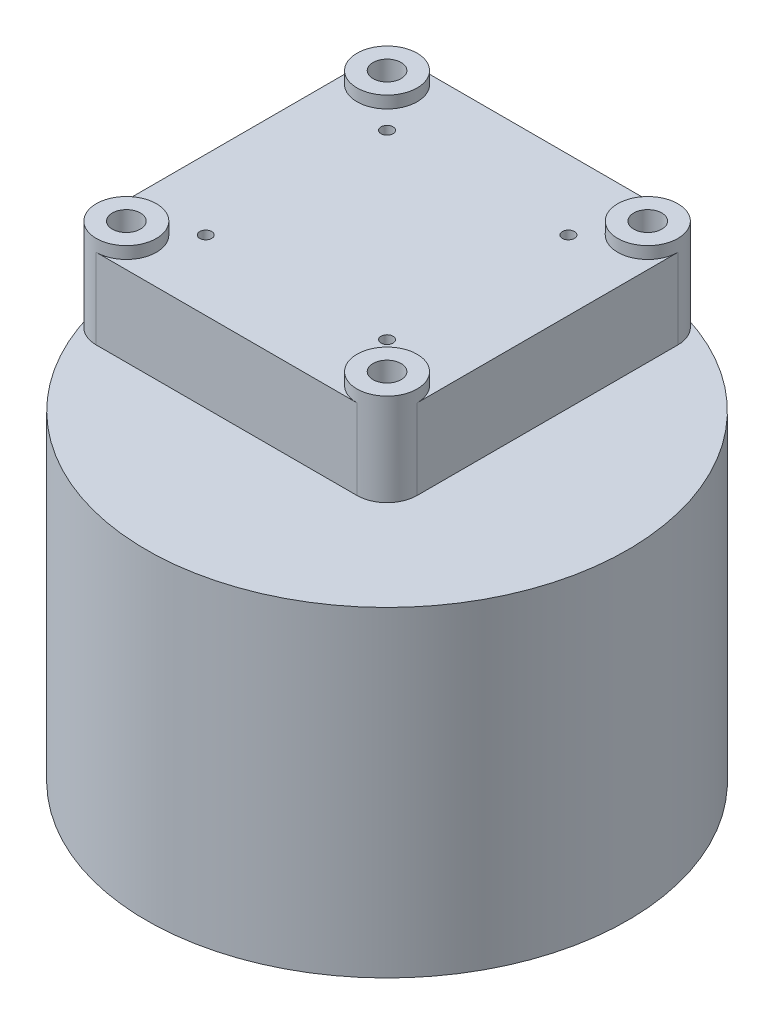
ISO-10303-21;
HEADER;
FILE_DESCRIPTION(('STEP AP214'),'2;1');
FILE_NAME('part.step','',(''),(''),'','','');
FILE_SCHEMA(('AUTOMOTIVE_DESIGN { 1 0 10303 214 1 1 1 1 }'));
ENDSEC;
DATA;
#1=APPLICATION_CONTEXT('core data for automotive mechanical design processes');
#2=APPLICATION_PROTOCOL_DEFINITION('international standard','automotive_design',2000,#1);
#3=PRODUCT_CONTEXT('',#1,'mechanical');
#4=PRODUCT('Part','Part','',(#3));
#5=PRODUCT_RELATED_PRODUCT_CATEGORY('part','',(#4));
#6=PRODUCT_DEFINITION_FORMATION('','',#4);
#7=PRODUCT_DEFINITION_CONTEXT('part definition',#1,'design');
#8=PRODUCT_DEFINITION('design','',#6,#7);
#9=PRODUCT_DEFINITION_SHAPE('','',#8);
#10=(LENGTH_UNIT() NAMED_UNIT(*) SI_UNIT(.MILLI.,.METRE.));
#11=(NAMED_UNIT(*) PLANE_ANGLE_UNIT() SI_UNIT($,.RADIAN.));
#12=(NAMED_UNIT(*) SI_UNIT($,.STERADIAN.) SOLID_ANGLE_UNIT());
#13=UNCERTAINTY_MEASURE_WITH_UNIT(LENGTH_MEASURE(1.E-05),#10,'distance_accuracy_value','');
#14=(GEOMETRIC_REPRESENTATION_CONTEXT(3) GLOBAL_UNCERTAINTY_ASSIGNED_CONTEXT((#13)) GLOBAL_UNIT_ASSIGNED_CONTEXT((#10,
#11,#12)) REPRESENTATION_CONTEXT('',''));
#15=CARTESIAN_POINT('',(0.,0.,0.));
#16=DIRECTION('',(0.,0.,1.));
#17=DIRECTION('',(1.,0.,0.));
#18=AXIS2_PLACEMENT_3D('',#15,#16,#17);
#19=CARTESIAN_POINT('',(-32.5,20.,32.5));
#20=DIRECTION('',(0.,-1.,0.));
#21=DIRECTION('',(0.,0.,-1.));
#22=AXIS2_PLACEMENT_3D('',#19,#20,#21);
#23=PLANE('',#22);
#24=CARTESIAN_POINT('',(22.6005050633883,20.,-22.6005050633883));
#25=DIRECTION('',(0.,1.,0.));
#26=DIRECTION('',(0.,0.,-1.));
#27=AXIS2_PLACEMENT_3D('',#24,#25,#26);
#28=CIRCLE('',#27,1.5);
#29=CARTESIAN_POINT('',(22.6005050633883,20.,-24.1005050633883));
#30=VERTEX_POINT('',#29);
#31=EDGE_CURVE('E169',#30,#30,#28,.T.);
#32=ORIENTED_EDGE('',*,*,#31,.F.);
#33=EDGE_LOOP('',(#32));
#34=FACE_BOUND('',#33,.T.);
#35=CARTESIAN_POINT('',(-22.6005050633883,20.,-22.6005050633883));
#36=DIRECTION('',(0.,1.,0.));
#37=DIRECTION('',(0.,0.,1.));
#38=AXIS2_PLACEMENT_3D('',#35,#36,#37);
#39=CIRCLE('',#38,1.5);
#40=CARTESIAN_POINT('',(-22.6005050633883,20.,-21.1005050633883));
#41=VERTEX_POINT('',#40);
#42=EDGE_CURVE('E175',#41,#41,#39,.T.);
#43=ORIENTED_EDGE('',*,*,#42,.F.);
#44=EDGE_LOOP('',(#43));
#45=FACE_BOUND('',#44,.T.);
#46=CARTESIAN_POINT('',(-22.6005050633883,20.,22.6005050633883));
#47=DIRECTION('',(0.,1.,0.));
#48=DIRECTION('',(0.,0.,-1.));
#49=AXIS2_PLACEMENT_3D('',#46,#47,#48);
#50=CIRCLE('',#49,1.5);
#51=CARTESIAN_POINT('',(-22.6005050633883,20.,21.1005050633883));
#52=VERTEX_POINT('',#51);
#53=EDGE_CURVE('E181',#52,#52,#50,.T.);
#54=ORIENTED_EDGE('',*,*,#53,.F.);
#55=EDGE_LOOP('',(#54));
#56=FACE_BOUND('',#55,.T.);
#57=CARTESIAN_POINT('',(22.6005050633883,20.,22.6005050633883));
#58=DIRECTION('',(0.,1.,0.));
#59=DIRECTION('',(0.,0.,1.));
#60=AXIS2_PLACEMENT_3D('',#57,#58,#59);
#61=CIRCLE('',#60,1.5);
#62=CARTESIAN_POINT('',(22.6005050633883,20.,24.1005050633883));
#63=VERTEX_POINT('',#62);
#64=EDGE_CURVE('E187',#63,#63,#61,.T.);
#65=ORIENTED_EDGE('',*,*,#64,.F.);
#66=EDGE_LOOP('',(#65));
#67=FACE_BOUND('',#66,.T.);
#68=CARTESIAN_POINT('',(-32.5,20.,-32.5));
#69=DIRECTION('',(0.,1.,0.));
#70=DIRECTION('',(0.,0.,-1.));
#71=AXIS2_PLACEMENT_3D('',#68,#69,#70);
#72=CIRCLE('',#71,7.5);
#73=CARTESIAN_POINT('',(-40.,20.,-32.5));
#74=VERTEX_POINT('',#73);
#75=CARTESIAN_POINT('',(-32.5,20.,-40.));
#76=VERTEX_POINT('',#75);
#77=EDGE_CURVE('E120',#74,#76,#72,.T.);
#78=ORIENTED_EDGE('',*,*,#77,.F.);
#79=DIRECTION('',(0.,0.,1.));
#80=VECTOR('',#79,1.);
#81=CARTESIAN_POINT('',(-40.,20.,32.5));
#82=LINE('',#81,#80);
#83=CARTESIAN_POINT('',(-40.,20.,32.5));
#84=VERTEX_POINT('',#83);
#85=EDGE_CURVE('E55',#74,#84,#82,.T.);
#86=ORIENTED_EDGE('',*,*,#85,.T.);
#87=CARTESIAN_POINT('',(-32.5,20.,32.5));
#88=DIRECTION('',(0.,1.,0.));
#89=DIRECTION('',(0.,0.,1.));
#90=AXIS2_PLACEMENT_3D('',#87,#88,#89);
#91=CIRCLE('',#90,7.5);
#92=CARTESIAN_POINT('',(-32.5,20.,40.));
#93=VERTEX_POINT('',#92);
#94=EDGE_CURVE('E136',#93,#84,#91,.T.);
#95=ORIENTED_EDGE('',*,*,#94,.F.);
#96=DIRECTION('',(1.,0.,0.));
#97=VECTOR('',#96,1.);
#98=CARTESIAN_POINT('',(-32.5,20.,40.));
#99=LINE('',#98,#97);
#100=CARTESIAN_POINT('',(32.4999999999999,20.,40.));
#101=VERTEX_POINT('',#100);
#102=EDGE_CURVE('E98',#93,#101,#99,.T.);
#103=ORIENTED_EDGE('',*,*,#102,.T.);
#104=CARTESIAN_POINT('',(32.5,20.,32.5));
#105=DIRECTION('',(0.,1.,0.));
#106=DIRECTION('',(0.,0.,-1.));
#107=AXIS2_PLACEMENT_3D('',#104,#105,#106);
#108=CIRCLE('',#107,7.5);
#109=CARTESIAN_POINT('',(40.,20.,32.5));
#110=VERTEX_POINT('',#109);
#111=EDGE_CURVE('E144',#110,#101,#108,.T.);
#112=ORIENTED_EDGE('',*,*,#111,.F.);
#113=DIRECTION('',(0.,0.,-1.));
#114=VECTOR('',#113,1.);
#115=CARTESIAN_POINT('',(40.,20.,32.5));
#116=LINE('',#115,#114);
#117=CARTESIAN_POINT('',(40.,20.,-32.5));
#118=VERTEX_POINT('',#117);
#119=EDGE_CURVE('E206',#110,#118,#116,.T.);
#120=ORIENTED_EDGE('',*,*,#119,.T.);
#121=CARTESIAN_POINT('',(32.5,20.,-32.5));
#122=DIRECTION('',(0.,1.,0.));
#123=DIRECTION('',(0.,0.,1.));
#124=AXIS2_PLACEMENT_3D('',#121,#122,#123);
#125=CIRCLE('',#124,7.5);
#126=CARTESIAN_POINT('',(32.4999999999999,20.,-40.));
#127=VERTEX_POINT('',#126);
#128=EDGE_CURVE('E11',#127,#118,#125,.T.);
#129=ORIENTED_EDGE('',*,*,#128,.F.);
#130=DIRECTION('',(-1.,0.,0.));
#131=VECTOR('',#130,1.);
#132=CARTESIAN_POINT('',(-32.5,20.,-40.));
#133=LINE('',#132,#131);
#134=EDGE_CURVE('E115',#127,#76,#133,.T.);
#135=ORIENTED_EDGE('',*,*,#134,.T.);
#136=EDGE_LOOP('',(#78,#86,#95,#103,#112,#120,#129,#135));
#137=FACE_BOUND('',#136,.T.);
#138=ADVANCED_FACE('F37',(#34,#45,#56,#67,#137),#23,.F.);
#139=CARTESIAN_POINT('',(-32.5,0.,32.5));
#140=DIRECTION('',(0.,-1.,0.));
#141=DIRECTION('',(0.,0.,-1.));
#142=AXIS2_PLACEMENT_3D('',#139,#140,#141);
#143=PLANE('',#142);
#144=CARTESIAN_POINT('',(0.,0.,0.));
#145=DIRECTION('',(0.,-1.,0.));
#146=DIRECTION('',(0.,0.,-1.));
#147=AXIS2_PLACEMENT_3D('',#144,#145,#146);
#148=CIRCLE('',#147,17.5);
#149=CARTESIAN_POINT('',(0.,0.,-17.5));
#150=VERTEX_POINT('',#149);
#151=EDGE_CURVE('E160',#150,#150,#148,.T.);
#152=ORIENTED_EDGE('',*,*,#151,.F.);
#153=EDGE_LOOP('',(#152));
#154=FACE_BOUND('',#153,.T.);
#155=CARTESIAN_POINT('',(-22.6005050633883,0.,-22.6005050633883));
#156=DIRECTION('',(0.,1.,0.));
#157=DIRECTION('',(0.,0.,1.));
#158=AXIS2_PLACEMENT_3D('',#155,#156,#157);
#159=CIRCLE('',#158,1.5);
#160=CARTESIAN_POINT('',(-22.6005050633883,0.,-21.1005050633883));
#161=VERTEX_POINT('',#160);
#162=EDGE_CURVE('E172',#161,#161,#159,.T.);
#163=ORIENTED_EDGE('',*,*,#162,.T.);
#164=EDGE_LOOP('',(#163));
#165=FACE_BOUND('',#164,.T.);
#166=CARTESIAN_POINT('',(22.6005050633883,0.,22.6005050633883));
#167=DIRECTION('',(0.,1.,0.));
#168=DIRECTION('',(0.,0.,1.));
#169=AXIS2_PLACEMENT_3D('',#166,#167,#168);
#170=CIRCLE('',#169,1.5);
#171=CARTESIAN_POINT('',(22.6005050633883,0.,24.1005050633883));
#172=VERTEX_POINT('',#171);
#173=EDGE_CURVE('E184',#172,#172,#170,.T.);
#174=ORIENTED_EDGE('',*,*,#173,.T.);
#175=EDGE_LOOP('',(#174));
#176=FACE_BOUND('',#175,.T.);
#177=CARTESIAN_POINT('',(-32.5,0.,-32.5));
#178=DIRECTION('',(0.,1.,0.));
#179=DIRECTION('',(0.,0.,-1.));
#180=AXIS2_PLACEMENT_3D('',#177,#178,#179);
#181=CIRCLE('',#180,3.5);
#182=CARTESIAN_POINT('',(-32.5,0.,-36.));
#183=VERTEX_POINT('',#182);
#184=EDGE_CURVE('E195',#183,#183,#181,.T.);
#185=ORIENTED_EDGE('',*,*,#184,.T.);
#186=EDGE_LOOP('',(#185));
#187=FACE_BOUND('',#186,.T.);
#188=CARTESIAN_POINT('',(32.5,0.,-32.5));
#189=DIRECTION('',(0.,1.,0.));
#190=DIRECTION('',(0.,0.,1.));
#191=AXIS2_PLACEMENT_3D('',#188,#189,#190);
#192=CIRCLE('',#191,3.5);
#193=CARTESIAN_POINT('',(32.5,0.,-29.));
#194=VERTEX_POINT('',#193);
#195=EDGE_CURVE('E201',#194,#194,#192,.T.);
#196=ORIENTED_EDGE('',*,*,#195,.T.);
#197=EDGE_LOOP('',(#196));
#198=FACE_BOUND('',#197,.T.);
#199=CARTESIAN_POINT('',(-32.5,0.,32.5));
#200=DIRECTION('',(0.,1.,0.));
#201=DIRECTION('',(0.,0.,-1.));
#202=AXIS2_PLACEMENT_3D('',#199,#200,#201);
#203=CIRCLE('',#202,7.5);
#204=CARTESIAN_POINT('',(-40.,0.,32.5));
#205=VERTEX_POINT('',#204);
#206=CARTESIAN_POINT('',(-32.5,0.,40.));
#207=VERTEX_POINT('',#206);
#208=EDGE_CURVE('E204',#205,#207,#203,.T.);
#209=ORIENTED_EDGE('',*,*,#208,.F.);
#210=DIRECTION('',(0.,0.,1.));
#211=VECTOR('',#210,1.);
#212=CARTESIAN_POINT('',(-40.,0.,32.5));
#213=LINE('',#212,#211);
#214=CARTESIAN_POINT('',(-40.,0.,-32.4999999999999));
#215=VERTEX_POINT('',#214);
#216=EDGE_CURVE('E92',#215,#205,#213,.T.);
#217=ORIENTED_EDGE('',*,*,#216,.F.);
#218=CARTESIAN_POINT('',(-32.5,0.,-32.5));
#219=DIRECTION('',(0.,1.,0.));
#220=DIRECTION('',(0.,0.,-1.));
#221=AXIS2_PLACEMENT_3D('',#218,#219,#220);
#222=CIRCLE('',#221,7.5);
#223=CARTESIAN_POINT('',(-32.5,0.,-40.));
#224=VERTEX_POINT('',#223);
#225=EDGE_CURVE('E86',#224,#215,#222,.T.);
#226=ORIENTED_EDGE('',*,*,#225,.F.);
#227=DIRECTION('',(-1.,0.,0.));
#228=VECTOR('',#227,1.);
#229=CARTESIAN_POINT('',(-32.5,0.,-40.));
#230=LINE('',#229,#228);
#231=CARTESIAN_POINT('',(32.4999999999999,0.,-40.));
#232=VERTEX_POINT('',#231);
#233=EDGE_CURVE('E220',#232,#224,#230,.T.);
#234=ORIENTED_EDGE('',*,*,#233,.F.);
#235=CARTESIAN_POINT('',(32.5,0.,-32.5));
#236=DIRECTION('',(0.,1.,0.));
#237=DIRECTION('',(0.,0.,-1.));
#238=AXIS2_PLACEMENT_3D('',#235,#236,#237);
#239=CIRCLE('',#238,7.5);
#240=CARTESIAN_POINT('',(40.,0.,-32.4999999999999));
#241=VERTEX_POINT('',#240);
#242=EDGE_CURVE('E218',#241,#232,#239,.T.);
#243=ORIENTED_EDGE('',*,*,#242,.F.);
#244=DIRECTION('',(0.,0.,-1.));
#245=VECTOR('',#244,1.);
#246=CARTESIAN_POINT('',(40.,0.,32.5));
#247=LINE('',#246,#245);
#248=CARTESIAN_POINT('',(40.,0.,32.5));
#249=VERTEX_POINT('',#248);
#250=EDGE_CURVE('E216',#249,#241,#247,.T.);
#251=ORIENTED_EDGE('',*,*,#250,.F.);
#252=CARTESIAN_POINT('',(32.5,0.,32.5));
#253=DIRECTION('',(0.,1.,0.));
#254=DIRECTION('',(0.,0.,1.));
#255=AXIS2_PLACEMENT_3D('',#252,#253,#254);
#256=CIRCLE('',#255,7.5);
#257=CARTESIAN_POINT('',(32.4999999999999,0.,40.));
#258=VERTEX_POINT('',#257);
#259=EDGE_CURVE('E214',#258,#249,#256,.T.);
#260=ORIENTED_EDGE('',*,*,#259,.F.);
#261=DIRECTION('',(1.,0.,0.));
#262=VECTOR('',#261,1.);
#263=CARTESIAN_POINT('',(-32.5,0.,40.));
#264=LINE('',#263,#262);
#265=EDGE_CURVE('E212',#207,#258,#264,.T.);
#266=ORIENTED_EDGE('',*,*,#265,.F.);
#267=EDGE_LOOP('',(#209,#217,#226,#234,#243,#251,#260,#266));
#268=FACE_BOUND('',#267,.T.);
#269=CARTESIAN_POINT('',(-32.5,0.,32.5));
#270=DIRECTION('',(0.,1.,0.));
#271=DIRECTION('',(0.,0.,-1.));
#272=AXIS2_PLACEMENT_3D('',#269,#270,#271);
#273=CIRCLE('',#272,3.49999999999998);
#274=CARTESIAN_POINT('',(-32.5,0.,29.0000000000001));
#275=VERTEX_POINT('',#274);
#276=EDGE_CURVE('E198',#275,#275,#273,.T.);
#277=ORIENTED_EDGE('',*,*,#276,.T.);
#278=EDGE_LOOP('',(#277));
#279=FACE_BOUND('',#278,.T.);
#280=CARTESIAN_POINT('',(32.5,0.,32.5));
#281=DIRECTION('',(0.,1.,0.));
#282=DIRECTION('',(0.,0.,1.));
#283=AXIS2_PLACEMENT_3D('',#280,#281,#282);
#284=CIRCLE('',#283,3.50000000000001);
#285=CARTESIAN_POINT('',(32.5,0.,36.));
#286=VERTEX_POINT('',#285);
#287=EDGE_CURVE('E190',#286,#286,#284,.T.);
#288=ORIENTED_EDGE('',*,*,#287,.T.);
#289=EDGE_LOOP('',(#288));
#290=FACE_BOUND('',#289,.T.);
#291=CARTESIAN_POINT('',(-22.6005050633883,0.,22.6005050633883));
#292=DIRECTION('',(0.,1.,0.));
#293=DIRECTION('',(0.,0.,-1.));
#294=AXIS2_PLACEMENT_3D('',#291,#292,#293);
#295=CIRCLE('',#294,1.5);
#296=CARTESIAN_POINT('',(-22.6005050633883,0.,21.1005050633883));
#297=VERTEX_POINT('',#296);
#298=EDGE_CURVE('E178',#297,#297,#295,.T.);
#299=ORIENTED_EDGE('',*,*,#298,.T.);
#300=EDGE_LOOP('',(#299));
#301=FACE_BOUND('',#300,.T.);
#302=CARTESIAN_POINT('',(22.6005050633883,0.,-22.6005050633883));
#303=DIRECTION('',(0.,1.,0.));
#304=DIRECTION('',(0.,0.,-1.));
#305=AXIS2_PLACEMENT_3D('',#302,#303,#304);
#306=CIRCLE('',#305,1.5);
#307=CARTESIAN_POINT('',(22.6005050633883,0.,-24.1005050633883));
#308=VERTEX_POINT('',#307);
#309=EDGE_CURVE('E166',#308,#308,#306,.T.);
#310=ORIENTED_EDGE('',*,*,#309,.T.);
#311=EDGE_LOOP('',(#310));
#312=FACE_BOUND('',#311,.T.);
#313=ADVANCED_FACE('F245',(#154,#165,#176,#187,#198,#268,#279,#290,#301,#312),#143,.T.);
#314=CARTESIAN_POINT('',(-32.5,20.,32.5));
#315=DIRECTION('',(0.,-1.,0.));
#316=DIRECTION('',(0.,0.,-1.));
#317=AXIS2_PLACEMENT_3D('',#314,#315,#316);
#318=CYLINDRICAL_SURFACE('',#317,7.5);
#319=ORIENTED_EDGE('',*,*,#208,.T.);
#320=DIRECTION('',(0.,-1.,0.));
#321=VECTOR('',#320,1.);
#322=CARTESIAN_POINT('',(-32.5,20.,40.));
#323=LINE('',#322,#321);
#324=EDGE_CURVE('E41',#93,#207,#323,.T.);
#325=ORIENTED_EDGE('',*,*,#324,.F.);
#326=ORIENTED_EDGE('',*,*,#94,.T.);
#327=DIRECTION('',(0.,-1.,0.));
#328=VECTOR('',#327,1.);
#329=CARTESIAN_POINT('',(-40.,20.,32.5));
#330=LINE('',#329,#328);
#331=EDGE_CURVE('E113',#84,#205,#330,.T.);
#332=ORIENTED_EDGE('',*,*,#331,.T.);
#333=EDGE_LOOP('',(#319,#325,#326,#332));
#334=FACE_BOUND('',#333,.T.);
#335=CARTESIAN_POINT('',(-32.5,23.,32.5));
#336=DIRECTION('',(0.,1.,0.));
#337=DIRECTION('',(0.,0.,1.));
#338=AXIS2_PLACEMENT_3D('',#335,#336,#337);
#339=CIRCLE('',#338,7.5);
#340=CARTESIAN_POINT('',(-32.5,23.,40.));
#341=VERTEX_POINT('',#340);
#342=EDGE_CURVE('E137',#341,#341,#339,.T.);
#343=ORIENTED_EDGE('',*,*,#342,.F.);
#344=EDGE_LOOP('',(#343));
#345=FACE_BOUND('',#344,.T.);
#346=ADVANCED_FACE('F39',(#334,#345),#318,.T.);
#347=CARTESIAN_POINT('',(-32.5,20.,40.));
#348=DIRECTION('',(0.,0.,-1.));
#349=DIRECTION('',(-1.,0.,0.));
#350=AXIS2_PLACEMENT_3D('',#347,#348,#349);
#351=PLANE('',#350);
#352=ORIENTED_EDGE('',*,*,#265,.T.);
#353=DIRECTION('',(0.,-1.,0.));
#354=VECTOR('',#353,1.);
#355=CARTESIAN_POINT('',(32.4999999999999,20.,40.));
#356=LINE('',#355,#354);
#357=EDGE_CURVE('E234',#101,#258,#356,.T.);
#358=ORIENTED_EDGE('',*,*,#357,.F.);
#359=ORIENTED_EDGE('',*,*,#102,.F.);
#360=ORIENTED_EDGE('',*,*,#324,.T.);
#361=EDGE_LOOP('',(#352,#358,#359,#360));
#362=FACE_BOUND('',#361,.T.);
#363=ADVANCED_FACE('F240',(#362),#351,.F.);
#364=CARTESIAN_POINT('',(32.5,20.,32.5));
#365=DIRECTION('',(0.,-1.,0.));
#366=DIRECTION('',(0.,0.,-1.));
#367=AXIS2_PLACEMENT_3D('',#364,#365,#366);
#368=CYLINDRICAL_SURFACE('',#367,7.5);
#369=ORIENTED_EDGE('',*,*,#259,.T.);
#370=DIRECTION('',(0.,-1.,0.));
#371=VECTOR('',#370,1.);
#372=CARTESIAN_POINT('',(40.,20.,32.5));
#373=LINE('',#372,#371);
#374=EDGE_CURVE('E232',#110,#249,#373,.T.);
#375=ORIENTED_EDGE('',*,*,#374,.F.);
#376=ORIENTED_EDGE('',*,*,#111,.T.);
#377=ORIENTED_EDGE('',*,*,#357,.T.);
#378=EDGE_LOOP('',(#369,#375,#376,#377));
#379=FACE_BOUND('',#378,.T.);
#380=CARTESIAN_POINT('',(32.5,23.,32.5));
#381=DIRECTION('',(0.,1.,0.));
#382=DIRECTION('',(0.,0.,-1.));
#383=AXIS2_PLACEMENT_3D('',#380,#381,#382);
#384=CIRCLE('',#383,7.5);
#385=CARTESIAN_POINT('',(32.5,23.,25.));
#386=VERTEX_POINT('',#385);
#387=EDGE_CURVE('E145',#386,#386,#384,.T.);
#388=ORIENTED_EDGE('',*,*,#387,.F.);
#389=EDGE_LOOP('',(#388));
#390=FACE_BOUND('',#389,.T.);
#391=ADVANCED_FACE('F250',(#379,#390),#368,.T.);
#392=CARTESIAN_POINT('',(40.,20.,32.5));
#393=DIRECTION('',(-1.,0.,0.));
#394=DIRECTION('',(0.,0.,1.));
#395=AXIS2_PLACEMENT_3D('',#392,#393,#394);
#396=PLANE('',#395);
#397=ORIENTED_EDGE('',*,*,#250,.T.);
#398=DIRECTION('',(0.,-1.,0.));
#399=VECTOR('',#398,1.);
#400=CARTESIAN_POINT('',(40.,20.,-32.4999999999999));
#401=LINE('',#400,#399);
#402=EDGE_CURVE('E229',#118,#241,#401,.T.);
#403=ORIENTED_EDGE('',*,*,#402,.F.);
#404=ORIENTED_EDGE('',*,*,#119,.F.);
#405=ORIENTED_EDGE('',*,*,#374,.T.);
#406=EDGE_LOOP('',(#397,#403,#404,#405));
#407=FACE_BOUND('',#406,.T.);
#408=ADVANCED_FACE('F253',(#407),#396,.F.);
#409=CARTESIAN_POINT('',(32.5,20.,-32.5));
#410=DIRECTION('',(0.,-1.,0.));
#411=DIRECTION('',(0.,0.,-1.));
#412=AXIS2_PLACEMENT_3D('',#409,#410,#411);
#413=CYLINDRICAL_SURFACE('',#412,7.5);
#414=ORIENTED_EDGE('',*,*,#242,.T.);
#415=DIRECTION('',(0.,-1.,0.));
#416=VECTOR('',#415,1.);
#417=CARTESIAN_POINT('',(32.4999999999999,20.,-40.));
#418=LINE('',#417,#416);
#419=EDGE_CURVE('E226',#127,#232,#418,.T.);
#420=ORIENTED_EDGE('',*,*,#419,.F.);
#421=ORIENTED_EDGE('',*,*,#128,.T.);
#422=ORIENTED_EDGE('',*,*,#402,.T.);
#423=EDGE_LOOP('',(#414,#420,#421,#422));
#424=FACE_BOUND('',#423,.T.);
#425=CARTESIAN_POINT('',(32.5,23.,-32.5));
#426=DIRECTION('',(0.,1.,0.));
#427=DIRECTION('',(0.,0.,1.));
#428=AXIS2_PLACEMENT_3D('',#425,#426,#427);
#429=CIRCLE('',#428,7.5);
#430=CARTESIAN_POINT('',(32.5,23.,-25.));
#431=VERTEX_POINT('',#430);
#432=EDGE_CURVE('E153',#431,#431,#429,.T.);
#433=ORIENTED_EDGE('',*,*,#432,.F.);
#434=EDGE_LOOP('',(#433));
#435=FACE_BOUND('',#434,.T.);
#436=ADVANCED_FACE('F256',(#424,#435),#413,.T.);
#437=CARTESIAN_POINT('',(-32.5,20.,-40.));
#438=DIRECTION('',(0.,0.,1.));
#439=DIRECTION('',(1.,0.,0.));
#440=AXIS2_PLACEMENT_3D('',#437,#438,#439);
#441=PLANE('',#440);
#442=ORIENTED_EDGE('',*,*,#233,.T.);
#443=DIRECTION('',(0.,-1.,0.));
#444=VECTOR('',#443,1.);
#445=CARTESIAN_POINT('',(-32.5,20.,-40.));
#446=LINE('',#445,#444);
#447=EDGE_CURVE('E121',#76,#224,#446,.T.);
#448=ORIENTED_EDGE('',*,*,#447,.F.);
#449=ORIENTED_EDGE('',*,*,#134,.F.);
#450=ORIENTED_EDGE('',*,*,#419,.T.);
#451=EDGE_LOOP('',(#442,#448,#449,#450));
#452=FACE_BOUND('',#451,.T.);
#453=ADVANCED_FACE('F260',(#452),#441,.F.);
#454=CARTESIAN_POINT('',(-32.5,20.,-32.5));
#455=DIRECTION('',(0.,-1.,0.));
#456=DIRECTION('',(0.,0.,-1.));
#457=AXIS2_PLACEMENT_3D('',#454,#455,#456);
#458=CYLINDRICAL_SURFACE('',#457,7.5);
#459=ORIENTED_EDGE('',*,*,#225,.T.);
#460=DIRECTION('',(0.,-1.,0.));
#461=VECTOR('',#460,1.);
#462=CARTESIAN_POINT('',(-40.,20.,-32.4999999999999));
#463=LINE('',#462,#461);
#464=EDGE_CURVE('E112',#74,#215,#463,.T.);
#465=ORIENTED_EDGE('',*,*,#464,.F.);
#466=ORIENTED_EDGE('',*,*,#77,.T.);
#467=ORIENTED_EDGE('',*,*,#447,.T.);
#468=EDGE_LOOP('',(#459,#465,#466,#467));
#469=FACE_BOUND('',#468,.T.);
#470=CARTESIAN_POINT('',(-32.5,23.,-32.5));
#471=DIRECTION('',(0.,1.,0.));
#472=DIRECTION('',(0.,0.,-1.));
#473=AXIS2_PLACEMENT_3D('',#470,#471,#472);
#474=CIRCLE('',#473,7.5);
#475=CARTESIAN_POINT('',(-32.5,23.,-40.));
#476=VERTEX_POINT('',#475);
#477=EDGE_CURVE('E125',#476,#476,#474,.T.);
#478=ORIENTED_EDGE('',*,*,#477,.F.);
#479=EDGE_LOOP('',(#478));
#480=FACE_BOUND('',#479,.T.);
#481=ADVANCED_FACE('F118',(#469,#480),#458,.T.);
#482=CARTESIAN_POINT('',(-40.,20.,32.5));
#483=DIRECTION('',(1.,0.,0.));
#484=DIRECTION('',(0.,0.,-1.));
#485=AXIS2_PLACEMENT_3D('',#482,#483,#484);
#486=PLANE('',#485);
#487=ORIENTED_EDGE('',*,*,#216,.T.);
#488=ORIENTED_EDGE('',*,*,#331,.F.);
#489=ORIENTED_EDGE('',*,*,#85,.F.);
#490=ORIENTED_EDGE('',*,*,#464,.T.);
#491=EDGE_LOOP('',(#487,#488,#489,#490));
#492=FACE_BOUND('',#491,.T.);
#493=ADVANCED_FACE('F111',(#492),#486,.F.);
#494=CARTESIAN_POINT('',(32.5,20.,-32.5));
#495=DIRECTION('',(0.,-1.,0.));
#496=DIRECTION('',(0.,0.,-1.));
#497=AXIS2_PLACEMENT_3D('',#494,#495,#496);
#498=CYLINDRICAL_SURFACE('',#497,3.5);
#499=ORIENTED_EDGE('',*,*,#195,.F.);
#500=EDGE_LOOP('',(#499));
#501=FACE_BOUND('',#500,.T.);
#502=CARTESIAN_POINT('',(32.5,23.,-32.5));
#503=DIRECTION('',(0.,1.,0.));
#504=DIRECTION('',(0.,0.,1.));
#505=AXIS2_PLACEMENT_3D('',#502,#503,#504);
#506=CIRCLE('',#505,3.50000000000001);
#507=CARTESIAN_POINT('',(32.5,23.,-29.));
#508=VERTEX_POINT('',#507);
#509=EDGE_CURVE('E148',#508,#508,#506,.T.);
#510=ORIENTED_EDGE('',*,*,#509,.T.);
#511=EDGE_LOOP('',(#510));
#512=FACE_BOUND('',#511,.T.);
#513=ADVANCED_FACE('F280',(#501,#512),#498,.F.);
#514=CARTESIAN_POINT('',(-32.5,20.,32.5));
#515=DIRECTION('',(0.,-1.,0.));
#516=DIRECTION('',(0.,0.,-1.));
#517=AXIS2_PLACEMENT_3D('',#514,#515,#516);
#518=CYLINDRICAL_SURFACE('',#517,3.49999999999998);
#519=ORIENTED_EDGE('',*,*,#276,.F.);
#520=EDGE_LOOP('',(#519));
#521=FACE_BOUND('',#520,.T.);
#522=CARTESIAN_POINT('',(-32.5,23.,32.5));
#523=DIRECTION('',(0.,1.,0.));
#524=DIRECTION('',(0.,0.,1.));
#525=AXIS2_PLACEMENT_3D('',#522,#523,#524);
#526=CIRCLE('',#525,3.50000000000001);
#527=CARTESIAN_POINT('',(-32.5,23.,36.));
#528=VERTEX_POINT('',#527);
#529=EDGE_CURVE('E129',#528,#528,#526,.T.);
#530=ORIENTED_EDGE('',*,*,#529,.T.);
#531=EDGE_LOOP('',(#530));
#532=FACE_BOUND('',#531,.T.);
#533=ADVANCED_FACE('F287',(#521,#532),#518,.F.);
#534=CARTESIAN_POINT('',(-32.5,20.,-32.5));
#535=DIRECTION('',(0.,-1.,0.));
#536=DIRECTION('',(0.,0.,-1.));
#537=AXIS2_PLACEMENT_3D('',#534,#535,#536);
#538=CYLINDRICAL_SURFACE('',#537,3.5);
#539=ORIENTED_EDGE('',*,*,#184,.F.);
#540=EDGE_LOOP('',(#539));
#541=FACE_BOUND('',#540,.T.);
#542=CARTESIAN_POINT('',(-32.5,23.,-32.5));
#543=DIRECTION('',(0.,1.,0.));
#544=DIRECTION('',(0.,0.,-1.));
#545=AXIS2_PLACEMENT_3D('',#542,#543,#544);
#546=CIRCLE('',#545,3.50000000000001);
#547=CARTESIAN_POINT('',(-32.5,23.,-36.));
#548=VERTEX_POINT('',#547);
#549=EDGE_CURVE('E126',#548,#548,#546,.T.);
#550=ORIENTED_EDGE('',*,*,#549,.T.);
#551=EDGE_LOOP('',(#550));
#552=FACE_BOUND('',#551,.T.);
#553=ADVANCED_FACE('F292',(#541,#552),#538,.F.);
#554=CARTESIAN_POINT('',(32.5,20.,32.5));
#555=DIRECTION('',(0.,-1.,0.));
#556=DIRECTION('',(0.,0.,-1.));
#557=AXIS2_PLACEMENT_3D('',#554,#555,#556);
#558=CYLINDRICAL_SURFACE('',#557,3.50000000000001);
#559=ORIENTED_EDGE('',*,*,#287,.F.);
#560=EDGE_LOOP('',(#559));
#561=FACE_BOUND('',#560,.T.);
#562=CARTESIAN_POINT('',(32.5,23.,32.5));
#563=DIRECTION('',(0.,1.,0.));
#564=DIRECTION('',(0.,0.,-1.));
#565=AXIS2_PLACEMENT_3D('',#562,#563,#564);
#566=CIRCLE('',#565,3.50000000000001);
#567=CARTESIAN_POINT('',(32.5,23.,29.));
#568=VERTEX_POINT('',#567);
#569=EDGE_CURVE('E140',#568,#568,#566,.T.);
#570=ORIENTED_EDGE('',*,*,#569,.T.);
#571=EDGE_LOOP('',(#570));
#572=FACE_BOUND('',#571,.T.);
#573=ADVANCED_FACE('F342',(#561,#572),#558,.F.);
#574=CARTESIAN_POINT('',(22.6005050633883,20.,22.6005050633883));
#575=DIRECTION('',(0.,-1.,0.));
#576=DIRECTION('',(0.,0.,-1.));
#577=AXIS2_PLACEMENT_3D('',#574,#575,#576);
#578=CYLINDRICAL_SURFACE('',#577,1.5);
#579=ORIENTED_EDGE('',*,*,#64,.T.);
#580=EDGE_LOOP('',(#579));
#581=FACE_BOUND('',#580,.T.);
#582=ORIENTED_EDGE('',*,*,#173,.F.);
#583=EDGE_LOOP('',(#582));
#584=FACE_BOUND('',#583,.T.);
#585=ADVANCED_FACE('F338',(#581,#584),#578,.F.);
#586=CARTESIAN_POINT('',(-22.6005050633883,20.,22.6005050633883));
#587=DIRECTION('',(0.,-1.,0.));
#588=DIRECTION('',(0.,0.,-1.));
#589=AXIS2_PLACEMENT_3D('',#586,#587,#588);
#590=CYLINDRICAL_SURFACE('',#589,1.5);
#591=ORIENTED_EDGE('',*,*,#53,.T.);
#592=EDGE_LOOP('',(#591));
#593=FACE_BOUND('',#592,.T.);
#594=ORIENTED_EDGE('',*,*,#298,.F.);
#595=EDGE_LOOP('',(#594));
#596=FACE_BOUND('',#595,.T.);
#597=ADVANCED_FACE('F334',(#593,#596),#590,.F.);
#598=CARTESIAN_POINT('',(-22.6005050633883,20.,-22.6005050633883));
#599=DIRECTION('',(0.,-1.,0.));
#600=DIRECTION('',(0.,0.,-1.));
#601=AXIS2_PLACEMENT_3D('',#598,#599,#600);
#602=CYLINDRICAL_SURFACE('',#601,1.5);
#603=ORIENTED_EDGE('',*,*,#42,.T.);
#604=EDGE_LOOP('',(#603));
#605=FACE_BOUND('',#604,.T.);
#606=ORIENTED_EDGE('',*,*,#162,.F.);
#607=EDGE_LOOP('',(#606));
#608=FACE_BOUND('',#607,.T.);
#609=ADVANCED_FACE('F330',(#605,#608),#602,.F.);
#610=CARTESIAN_POINT('',(22.6005050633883,20.,-22.6005050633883));
#611=DIRECTION('',(0.,-1.,0.));
#612=DIRECTION('',(0.,0.,-1.));
#613=AXIS2_PLACEMENT_3D('',#610,#611,#612);
#614=CYLINDRICAL_SURFACE('',#613,1.5);
#615=ORIENTED_EDGE('',*,*,#31,.T.);
#616=EDGE_LOOP('',(#615));
#617=FACE_BOUND('',#616,.T.);
#618=ORIENTED_EDGE('',*,*,#309,.F.);
#619=EDGE_LOOP('',(#618));
#620=FACE_BOUND('',#619,.T.);
#621=ADVANCED_FACE('F326',(#617,#620),#614,.F.);
#622=CARTESIAN_POINT('',(0.,-18.,0.));
#623=DIRECTION('',(0.,1.,0.));
#624=DIRECTION('',(0.,0.,1.));
#625=AXIS2_PLACEMENT_3D('',#622,#623,#624);
#626=CYLINDRICAL_SURFACE('',#625,17.5);
#627=CARTESIAN_POINT('',(0.,-18.,0.));
#628=DIRECTION('',(0.,-1.,0.));
#629=DIRECTION('',(0.,0.,-1.));
#630=AXIS2_PLACEMENT_3D('',#627,#628,#629);
#631=CIRCLE('',#630,17.5);
#632=CARTESIAN_POINT('',(0.,-18.,-17.5));
#633=VERTEX_POINT('',#632);
#634=EDGE_CURVE('E163',#633,#633,#631,.T.);
#635=ORIENTED_EDGE('',*,*,#634,.F.);
#636=EDGE_LOOP('',(#635));
#637=FACE_BOUND('',#636,.T.);
#638=ORIENTED_EDGE('',*,*,#151,.T.);
#639=EDGE_LOOP('',(#638));
#640=FACE_BOUND('',#639,.T.);
#641=ADVANCED_FACE('F322',(#637,#640),#626,.T.);
#642=CARTESIAN_POINT('',(0.,-98.,0.));
#643=DIRECTION('',(0.,1.,0.));
#644=DIRECTION('',(0.,0.,1.));
#645=AXIS2_PLACEMENT_3D('',#642,#643,#644);
#646=CYLINDRICAL_SURFACE('',#645,60.);
#647=CARTESIAN_POINT('',(0.,-98.,0.));
#648=DIRECTION('',(0.,-1.,0.));
#649=DIRECTION('',(0.,0.,-1.));
#650=AXIS2_PLACEMENT_3D('',#647,#648,#649);
#651=CIRCLE('',#650,60.);
#652=CARTESIAN_POINT('',(0.,-98.,-60.));
#653=VERTEX_POINT('',#652);
#654=EDGE_CURVE('E157',#653,#653,#651,.T.);
#655=ORIENTED_EDGE('',*,*,#654,.F.);
#656=EDGE_LOOP('',(#655));
#657=FACE_BOUND('',#656,.T.);
#658=CARTESIAN_POINT('',(0.,-18.,0.));
#659=DIRECTION('',(0.,-1.,0.));
#660=DIRECTION('',(0.,0.,-1.));
#661=AXIS2_PLACEMENT_3D('',#658,#659,#660);
#662=CIRCLE('',#661,60.);
#663=CARTESIAN_POINT('',(0.,-18.,-60.));
#664=VERTEX_POINT('',#663);
#665=EDGE_CURVE('E155',#664,#664,#662,.T.);
#666=ORIENTED_EDGE('',*,*,#665,.T.);
#667=EDGE_LOOP('',(#666));
#668=FACE_BOUND('',#667,.T.);
#669=ADVANCED_FACE('F317',(#657,#668),#646,.T.);
#670=CARTESIAN_POINT('',(0.,-98.,0.));
#671=DIRECTION('',(0.,-1.,0.));
#672=DIRECTION('',(0.,0.,-1.));
#673=AXIS2_PLACEMENT_3D('',#670,#671,#672);
#674=PLANE('',#673);
#675=ORIENTED_EDGE('',*,*,#654,.T.);
#676=EDGE_LOOP('',(#675));
#677=FACE_BOUND('',#676,.T.);
#678=ADVANCED_FACE('F311',(#677),#674,.T.);
#679=CARTESIAN_POINT('',(0.,-18.,0.));
#680=DIRECTION('',(0.,-1.,0.));
#681=DIRECTION('',(0.,0.,-1.));
#682=AXIS2_PLACEMENT_3D('',#679,#680,#681);
#683=PLANE('',#682);
#684=ORIENTED_EDGE('',*,*,#634,.T.);
#685=EDGE_LOOP('',(#684));
#686=FACE_BOUND('',#685,.T.);
#687=ORIENTED_EDGE('',*,*,#665,.F.);
#688=EDGE_LOOP('',(#687));
#689=FACE_BOUND('',#688,.T.);
#690=ADVANCED_FACE('F301',(#686,#689),#683,.F.);
#691=CARTESIAN_POINT('',(32.5,23.,-32.5));
#692=DIRECTION('',(0.,1.,0.));
#693=DIRECTION('',(0.,0.,1.));
#694=AXIS2_PLACEMENT_3D('',#691,#692,#693);
#695=PLANE('',#694);
#696=ORIENTED_EDGE('',*,*,#432,.T.);
#697=EDGE_LOOP('',(#696));
#698=FACE_BOUND('',#697,.T.);
#699=ORIENTED_EDGE('',*,*,#509,.F.);
#700=EDGE_LOOP('',(#699));
#701=FACE_BOUND('',#700,.T.);
#702=ADVANCED_FACE('F298',(#698,#701),#695,.T.);
#703=CARTESIAN_POINT('',(32.5,23.,32.5));
#704=DIRECTION('',(0.,-1.,0.));
#705=DIRECTION('',(0.,0.,-1.));
#706=AXIS2_PLACEMENT_3D('',#703,#704,#705);
#707=PLANE('',#706);
#708=ORIENTED_EDGE('',*,*,#387,.T.);
#709=EDGE_LOOP('',(#708));
#710=FACE_BOUND('',#709,.T.);
#711=ORIENTED_EDGE('',*,*,#569,.F.);
#712=EDGE_LOOP('',(#711));
#713=FACE_BOUND('',#712,.T.);
#714=ADVANCED_FACE('F300',(#710,#713),#707,.F.);
#715=CARTESIAN_POINT('',(-32.5,23.,32.5));
#716=DIRECTION('',(0.,1.,0.));
#717=DIRECTION('',(0.,0.,1.));
#718=AXIS2_PLACEMENT_3D('',#715,#716,#717);
#719=PLANE('',#718);
#720=ORIENTED_EDGE('',*,*,#342,.T.);
#721=EDGE_LOOP('',(#720));
#722=FACE_BOUND('',#721,.T.);
#723=ORIENTED_EDGE('',*,*,#529,.F.);
#724=EDGE_LOOP('',(#723));
#725=FACE_BOUND('',#724,.T.);
#726=ADVANCED_FACE('F308',(#722,#725),#719,.T.);
#727=CARTESIAN_POINT('',(-32.5,23.,-32.5));
#728=DIRECTION('',(0.,-1.,0.));
#729=DIRECTION('',(0.,0.,-1.));
#730=AXIS2_PLACEMENT_3D('',#727,#728,#729);
#731=PLANE('',#730);
#732=ORIENTED_EDGE('',*,*,#477,.T.);
#733=EDGE_LOOP('',(#732));
#734=FACE_BOUND('',#733,.T.);
#735=ORIENTED_EDGE('',*,*,#549,.F.);
#736=EDGE_LOOP('',(#735));
#737=FACE_BOUND('',#736,.T.);
#738=ADVANCED_FACE('F355',(#734,#737),#731,.F.);
#739=CLOSED_SHELL('',(#138,#313,#346,#363,#391,#408,#436,#453,#481,#493,#513,#533,#553,#573,
#585,#597,#609,#621,#641,#669,#678,#690,#702,#714,#726,#738));
#740=MANIFOLD_SOLID_BREP('B2',#739);
#741=ADVANCED_BREP_SHAPE_REPRESENTATION('',(#18,#740),#14);
#742=SHAPE_DEFINITION_REPRESENTATION(#9,#741);
ENDSEC;
END-ISO-10303-21;
